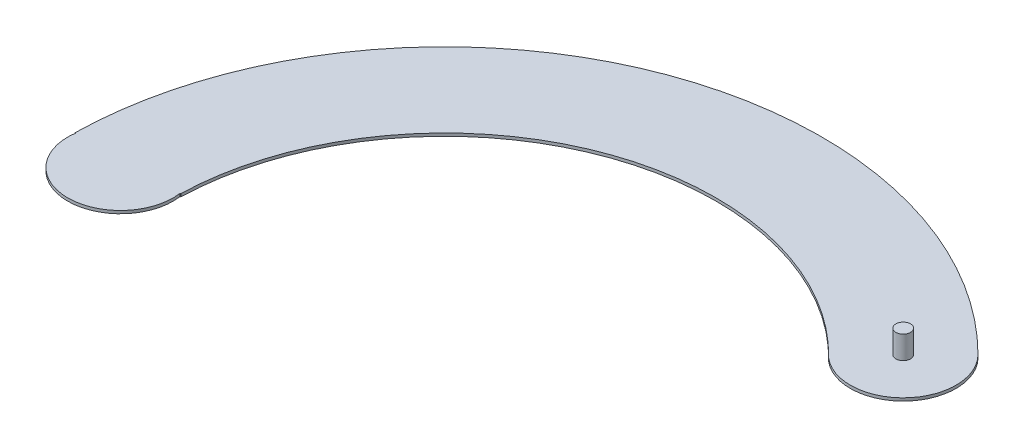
ISO-10303-21;
HEADER;
FILE_DESCRIPTION(('STEP AP214'),'2;1');
FILE_NAME('part.step','',(''),(''),'','','');
FILE_SCHEMA(('AUTOMOTIVE_DESIGN { 1 0 10303 214 1 1 1 1 }'));
ENDSEC;
DATA;
#1=APPLICATION_CONTEXT('core data for automotive mechanical design processes');
#2=APPLICATION_PROTOCOL_DEFINITION('international standard','automotive_design',2000,#1);
#3=PRODUCT_CONTEXT('',#1,'mechanical');
#4=PRODUCT('Part','Part','',(#3));
#5=PRODUCT_RELATED_PRODUCT_CATEGORY('part','',(#4));
#6=PRODUCT_DEFINITION_FORMATION('','',#4);
#7=PRODUCT_DEFINITION_CONTEXT('part definition',#1,'design');
#8=PRODUCT_DEFINITION('design','',#6,#7);
#9=PRODUCT_DEFINITION_SHAPE('','',#8);
#10=(LENGTH_UNIT() NAMED_UNIT(*) SI_UNIT(.MILLI.,.METRE.));
#11=(NAMED_UNIT(*) PLANE_ANGLE_UNIT() SI_UNIT($,.RADIAN.));
#12=(NAMED_UNIT(*) SI_UNIT($,.STERADIAN.) SOLID_ANGLE_UNIT());
#13=UNCERTAINTY_MEASURE_WITH_UNIT(LENGTH_MEASURE(1.E-05),#10,'distance_accuracy_value','');
#14=(GEOMETRIC_REPRESENTATION_CONTEXT(3) GLOBAL_UNCERTAINTY_ASSIGNED_CONTEXT((#13)) GLOBAL_UNIT_ASSIGNED_CONTEXT((#10,
#11,#12)) REPRESENTATION_CONTEXT('',''));
#15=CARTESIAN_POINT('',(0.,0.,0.));
#16=DIRECTION('',(0.,0.,1.));
#17=DIRECTION('',(1.,0.,0.));
#18=AXIS2_PLACEMENT_3D('',#15,#16,#17);
#19=CARTESIAN_POINT('',(0.,3.556,-1.));
#20=DIRECTION('',(0.,0.,-1.));
#21=DIRECTION('',(-1.,0.,0.));
#22=AXIS2_PLACEMENT_3D('',#19,#20,#21);
#23=PLANE('',#22);
#24=DIRECTION('',(1.,0.,0.));
#25=VECTOR('',#24,1.);
#26=CARTESIAN_POINT('',(0.,3.175,-1.));
#27=LINE('',#26,#25);
#28=CARTESIAN_POINT('',(-49.9899989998,3.175,-1.00000000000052));
#29=VERTEX_POINT('',#28);
#30=CARTESIAN_POINT('',(-49.9041866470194,3.175,-1.00000000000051));
#31=VERTEX_POINT('',#30);
#32=EDGE_CURVE('E125',#29,#31,#27,.T.);
#33=ORIENTED_EDGE('',*,*,#32,.T.);
#34=DIRECTION('',(0.,-1.,0.));
#35=VECTOR('',#34,1.);
#36=CARTESIAN_POINT('',(-49.9041866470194,3.556,-1.00000000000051));
#37=LINE('',#36,#35);
#38=CARTESIAN_POINT('',(-49.9041866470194,3.556,-1.00000000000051));
#39=VERTEX_POINT('',#38);
#40=EDGE_CURVE('E42',#39,#31,#37,.T.);
#41=ORIENTED_EDGE('',*,*,#40,.F.);
#42=DIRECTION('',(1.,0.,0.));
#43=VECTOR('',#42,1.);
#44=CARTESIAN_POINT('',(0.,3.556,-1.));
#45=LINE('',#44,#43);
#46=CARTESIAN_POINT('',(-49.9899989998,3.556,-1.00000000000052));
#47=VERTEX_POINT('',#46);
#48=EDGE_CURVE('E135',#47,#39,#45,.T.);
#49=ORIENTED_EDGE('',*,*,#48,.F.);
#50=DIRECTION('',(0.,-1.,0.));
#51=VECTOR('',#50,1.);
#52=CARTESIAN_POINT('',(-49.9899989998,3.556,-1.00000000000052));
#53=LINE('',#52,#51);
#54=EDGE_CURVE('E121',#47,#29,#53,.T.);
#55=ORIENTED_EDGE('',*,*,#54,.T.);
#56=EDGE_LOOP('',(#33,#41,#49,#55));
#57=FACE_BOUND('',#56,.T.);
#58=ADVANCED_FACE('F38',(#57),#23,.F.);
#59=CARTESIAN_POINT('',(-42.9880537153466,3.556,-4.44089209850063E-13));
#60=DIRECTION('',(0.,-1.,0.));
#61=DIRECTION('',(0.,0.,-1.));
#62=AXIS2_PLACEMENT_3D('',#59,#60,#61);
#63=CYLINDRICAL_SURFACE('',#62,6.98805371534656);
#64=CARTESIAN_POINT('',(-42.9880537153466,3.175,-4.44089209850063E-13));
#65=DIRECTION('',(0.,1.,0.));
#66=DIRECTION('',(0.,0.,1.));
#67=AXIS2_PLACEMENT_3D('',#64,#65,#66);
#68=CIRCLE('',#67,6.98805371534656);
#69=CARTESIAN_POINT('',(-36.0719207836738,3.175,-1.00000000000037));
#70=VERTEX_POINT('',#69);
#71=EDGE_CURVE('E128',#31,#70,#68,.T.);
#72=ORIENTED_EDGE('',*,*,#71,.T.);
#73=DIRECTION('',(0.,-1.,0.));
#74=VECTOR('',#73,1.);
#75=CARTESIAN_POINT('',(-36.0719207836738,3.556,-1.00000000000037));
#76=LINE('',#75,#74);
#77=CARTESIAN_POINT('',(-36.0719207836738,3.556,-1.00000000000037));
#78=VERTEX_POINT('',#77);
#79=EDGE_CURVE('E138',#78,#70,#76,.T.);
#80=ORIENTED_EDGE('',*,*,#79,.F.);
#81=CARTESIAN_POINT('',(-42.9880537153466,3.556,-4.44089209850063E-13));
#82=DIRECTION('',(0.,1.,0.));
#83=DIRECTION('',(0.,0.,1.));
#84=AXIS2_PLACEMENT_3D('',#81,#82,#83);
#85=CIRCLE('',#84,6.98805371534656);
#86=EDGE_CURVE('E94',#39,#78,#85,.T.);
#87=ORIENTED_EDGE('',*,*,#86,.F.);
#88=ORIENTED_EDGE('',*,*,#40,.T.);
#89=EDGE_LOOP('',(#72,#80,#87,#88));
#90=FACE_BOUND('',#89,.T.);
#91=ADVANCED_FACE('F40',(#90),#63,.T.);
#92=CARTESIAN_POINT('',(-35.9861084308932,3.175,-1.00000000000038));
#93=VERTEX_POINT('',#92);
#94=EDGE_CURVE('E130',#70,#93,#27,.T.);
#95=ORIENTED_EDGE('',*,*,#94,.T.);
#96=DIRECTION('',(0.,-1.,0.));
#97=VECTOR('',#96,1.);
#98=CARTESIAN_POINT('',(-35.9861084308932,3.556,-1.00000000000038));
#99=LINE('',#98,#97);
#100=CARTESIAN_POINT('',(-35.9861084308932,3.556,-1.00000000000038));
#101=VERTEX_POINT('',#100);
#102=EDGE_CURVE('E116',#101,#93,#99,.T.);
#103=ORIENTED_EDGE('',*,*,#102,.F.);
#104=EDGE_CURVE('E107',#78,#101,#45,.T.);
#105=ORIENTED_EDGE('',*,*,#104,.F.);
#106=ORIENTED_EDGE('',*,*,#79,.T.);
#107=EDGE_LOOP('',(#95,#103,#105,#106));
#108=FACE_BOUND('',#107,.T.);
#109=ADVANCED_FACE('F148',(#108),#23,.F.);
#110=CARTESIAN_POINT('',(0.,3.556,0.));
#111=DIRECTION('',(0.,-1.,0.));
#112=DIRECTION('',(0.,0.,-1.));
#113=AXIS2_PLACEMENT_3D('',#110,#111,#112);
#114=CYLINDRICAL_SURFACE('',#113,36.);
#115=CARTESIAN_POINT('',(0.,3.175,0.));
#116=DIRECTION('',(0.,1.,0.));
#117=DIRECTION('',(0.,0.,1.));
#118=AXIS2_PLACEMENT_3D('',#115,#116,#117);
#119=CIRCLE('',#118,36.);
#120=CARTESIAN_POINT('',(25.8273295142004,3.175,-25.0788566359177));
#121=VERTEX_POINT('',#120);
#122=EDGE_CURVE('E115',#93,#121,#119,.F.);
#123=ORIENTED_EDGE('',*,*,#122,.T.);
#124=DIRECTION('',(0.,-1.,0.));
#125=VECTOR('',#124,1.);
#126=CARTESIAN_POINT('',(25.8273295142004,3.556,-25.0788566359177));
#127=LINE('',#126,#125);
#128=CARTESIAN_POINT('',(25.8273295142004,3.556,-25.0788566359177));
#129=VERTEX_POINT('',#128);
#130=EDGE_CURVE('E112',#129,#121,#127,.T.);
#131=ORIENTED_EDGE('',*,*,#130,.F.);
#132=CARTESIAN_POINT('',(0.,3.556,0.));
#133=DIRECTION('',(0.,1.,0.));
#134=DIRECTION('',(0.,0.,1.));
#135=AXIS2_PLACEMENT_3D('',#132,#133,#134);
#136=CIRCLE('',#135,36.);
#137=EDGE_CURVE('E101',#101,#129,#136,.F.);
#138=ORIENTED_EDGE('',*,*,#137,.F.);
#139=ORIENTED_EDGE('',*,*,#102,.T.);
#140=EDGE_LOOP('',(#123,#131,#138,#139));
#141=FACE_BOUND('',#140,.T.);
#142=ADVANCED_FACE('F113',(#141),#114,.F.);
#143=CARTESIAN_POINT('',(30.3971442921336,3.556,-30.3971442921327));
#144=DIRECTION('',(0.,-1.,0.));
#145=DIRECTION('',(0.,0.,-1.));
#146=AXIS2_PLACEMENT_3D('',#143,#144,#145);
#147=CYLINDRICAL_SURFACE('',#146,7.01194628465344);
#148=CARTESIAN_POINT('',(30.3971442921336,3.175,-30.3971442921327));
#149=DIRECTION('',(0.,1.,0.));
#150=DIRECTION('',(0.,0.,1.));
#151=AXIS2_PLACEMENT_3D('',#148,#149,#150);
#152=CIRCLE('',#151,7.01194628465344);
#153=CARTESIAN_POINT('',(35.355339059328,3.175,-35.3553390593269));
#154=VERTEX_POINT('',#153);
#155=EDGE_CURVE('E79',#121,#154,#152,.T.);
#156=ORIENTED_EDGE('',*,*,#155,.T.);
#157=DIRECTION('',(0.,-1.,0.));
#158=VECTOR('',#157,1.);
#159=CARTESIAN_POINT('',(35.355339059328,3.556,-35.3553390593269));
#160=LINE('',#159,#158);
#161=CARTESIAN_POINT('',(35.355339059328,3.556,-35.3553390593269));
#162=VERTEX_POINT('',#161);
#163=EDGE_CURVE('E117',#162,#154,#160,.T.);
#164=ORIENTED_EDGE('',*,*,#163,.F.);
#165=CARTESIAN_POINT('',(30.3971442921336,3.556,-30.3971442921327));
#166=DIRECTION('',(0.,1.,0.));
#167=DIRECTION('',(0.,0.,1.));
#168=AXIS2_PLACEMENT_3D('',#165,#166,#167);
#169=CIRCLE('',#168,7.01194628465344);
#170=EDGE_CURVE('E105',#129,#162,#169,.T.);
#171=ORIENTED_EDGE('',*,*,#170,.F.);
#172=ORIENTED_EDGE('',*,*,#130,.T.);
#173=EDGE_LOOP('',(#156,#164,#171,#172));
#174=FACE_BOUND('',#173,.T.);
#175=ADVANCED_FACE('F119',(#174),#147,.T.);
#176=CARTESIAN_POINT('',(0.,3.556,0.));
#177=DIRECTION('',(0.,-1.,0.));
#178=DIRECTION('',(0.,0.,-1.));
#179=AXIS2_PLACEMENT_3D('',#176,#177,#178);
#180=CYLINDRICAL_SURFACE('',#179,50.);
#181=CARTESIAN_POINT('',(0.,3.175,0.));
#182=DIRECTION('',(0.,1.,0.));
#183=DIRECTION('',(0.,0.,1.));
#184=AXIS2_PLACEMENT_3D('',#181,#182,#183);
#185=CIRCLE('',#184,50.);
#186=EDGE_CURVE('E85',#154,#29,#185,.T.);
#187=ORIENTED_EDGE('',*,*,#186,.T.);
#188=ORIENTED_EDGE('',*,*,#54,.F.);
#189=CARTESIAN_POINT('',(0.,3.556,0.));
#190=DIRECTION('',(0.,1.,0.));
#191=DIRECTION('',(0.,0.,1.));
#192=AXIS2_PLACEMENT_3D('',#189,#190,#191);
#193=CIRCLE('',#192,50.);
#194=EDGE_CURVE('E56',#162,#47,#193,.T.);
#195=ORIENTED_EDGE('',*,*,#194,.F.);
#196=ORIENTED_EDGE('',*,*,#163,.T.);
#197=EDGE_LOOP('',(#187,#188,#195,#196));
#198=FACE_BOUND('',#197,.T.);
#199=ADVANCED_FACE('F178',(#198),#180,.T.);
#200=CARTESIAN_POINT('',(0.,3.556,0.));
#201=DIRECTION('',(0.,1.,0.));
#202=DIRECTION('',(0.,0.,1.));
#203=AXIS2_PLACEMENT_3D('',#200,#201,#202);
#204=PLANE('',#203);
#205=CARTESIAN_POINT('',(30.3971442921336,3.556,-30.3971442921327));
#206=DIRECTION('',(0.,1.,0.));
#207=DIRECTION('',(0.,0.,1.));
#208=AXIS2_PLACEMENT_3D('',#205,#206,#207);
#209=CIRCLE('',#208,0.975);
#210=CARTESIAN_POINT('',(30.3971442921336,3.556,-31.3721442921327));
#211=VERTEX_POINT('',#210);
#212=EDGE_CURVE('E151',#211,#211,#209,.T.);
#213=ORIENTED_EDGE('',*,*,#212,.F.);
#214=EDGE_LOOP('',(#213));
#215=FACE_BOUND('',#214,.T.);
#216=ORIENTED_EDGE('',*,*,#48,.T.);
#217=ORIENTED_EDGE('',*,*,#86,.T.);
#218=ORIENTED_EDGE('',*,*,#104,.T.);
#219=ORIENTED_EDGE('',*,*,#137,.T.);
#220=ORIENTED_EDGE('',*,*,#170,.T.);
#221=ORIENTED_EDGE('',*,*,#194,.T.);
#222=EDGE_LOOP('',(#216,#217,#218,#219,#220,#221));
#223=FACE_BOUND('',#222,.T.);
#224=ADVANCED_FACE('F103',(#215,#223),#204,.T.);
#225=CARTESIAN_POINT('',(0.,3.175,0.));
#226=DIRECTION('',(0.,1.,0.));
#227=DIRECTION('',(0.,0.,1.));
#228=AXIS2_PLACEMENT_3D('',#225,#226,#227);
#229=PLANE('',#228);
#230=CARTESIAN_POINT('',(-42.9880537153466,3.175,-4.44089209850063E-13));
#231=DIRECTION('',(0.,-1.,0.));
#232=DIRECTION('',(0.,0.,-1.));
#233=AXIS2_PLACEMENT_3D('',#230,#231,#232);
#234=CIRCLE('',#233,0.974999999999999);
#235=CARTESIAN_POINT('',(-42.9880537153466,3.175,0.974999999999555));
#236=VERTEX_POINT('',#235);
#237=EDGE_CURVE('E11',#236,#236,#234,.T.);
#238=ORIENTED_EDGE('',*,*,#237,.F.);
#239=EDGE_LOOP('',(#238));
#240=FACE_BOUND('',#239,.T.);
#241=ORIENTED_EDGE('',*,*,#32,.F.);
#242=ORIENTED_EDGE('',*,*,#186,.F.);
#243=ORIENTED_EDGE('',*,*,#155,.F.);
#244=ORIENTED_EDGE('',*,*,#122,.F.);
#245=ORIENTED_EDGE('',*,*,#94,.F.);
#246=ORIENTED_EDGE('',*,*,#71,.F.);
#247=EDGE_LOOP('',(#241,#242,#243,#244,#245,#246));
#248=FACE_BOUND('',#247,.T.);
#249=ADVANCED_FACE('F147',(#240,#248),#229,.F.);
#250=CARTESIAN_POINT('',(30.3971442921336,6.604,-30.3971442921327));
#251=DIRECTION('',(0.,-1.,0.));
#252=DIRECTION('',(0.,0.,-1.));
#253=AXIS2_PLACEMENT_3D('',#250,#251,#252);
#254=CYLINDRICAL_SURFACE('',#253,0.975);
#255=CARTESIAN_POINT('',(30.3971442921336,6.604,-30.3971442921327));
#256=DIRECTION('',(0.,1.,0.));
#257=DIRECTION('',(0.,0.,1.));
#258=AXIS2_PLACEMENT_3D('',#255,#256,#257);
#259=CIRCLE('',#258,0.975);
#260=CARTESIAN_POINT('',(30.3971442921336,6.604,-31.3721442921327));
#261=VERTEX_POINT('',#260);
#262=EDGE_CURVE('E129',#261,#261,#259,.T.);
#263=CARTESIAN_POINT('',(30.3971442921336,6.604,-31.3721442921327));
#264=CARTESIAN_POINT('',(30.3971442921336,6.57225,-31.3721442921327));
#265=CARTESIAN_POINT('',(30.3971442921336,6.5405,-31.3721442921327));
#266=CARTESIAN_POINT('',(30.3971442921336,6.477,-31.3721442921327));
#267=CARTESIAN_POINT('',(30.3971442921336,6.44525,-31.3721442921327));
#268=CARTESIAN_POINT('',(30.3971442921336,6.38175,-31.3721442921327));
#269=CARTESIAN_POINT('',(30.3971442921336,6.35,-31.3721442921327));
#270=CARTESIAN_POINT('',(30.3971442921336,6.2865,-31.3721442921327));
#271=CARTESIAN_POINT('',(30.3971442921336,6.25475,-31.3721442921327));
#272=CARTESIAN_POINT('',(30.3971442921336,6.19125,-31.3721442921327));
#273=CARTESIAN_POINT('',(30.3971442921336,6.1595,-31.3721442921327));
#274=CARTESIAN_POINT('',(30.3971442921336,6.096,-31.3721442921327));
#275=CARTESIAN_POINT('',(30.3971442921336,6.06425,-31.3721442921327));
#276=CARTESIAN_POINT('',(30.3971442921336,6.00075,-31.3721442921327));
#277=CARTESIAN_POINT('',(30.3971442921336,5.969,-31.3721442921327));
#278=CARTESIAN_POINT('',(30.3971442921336,5.9055,-31.3721442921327));
#279=CARTESIAN_POINT('',(30.3971442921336,5.87375,-31.3721442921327));
#280=CARTESIAN_POINT('',(30.3971442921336,5.81025,-31.3721442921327));
#281=CARTESIAN_POINT('',(30.3971442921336,5.7785,-31.3721442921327));
#282=CARTESIAN_POINT('',(30.3971442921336,5.715,-31.3721442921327));
#283=CARTESIAN_POINT('',(30.3971442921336,5.68325,-31.3721442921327));
#284=CARTESIAN_POINT('',(30.3971442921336,5.61975,-31.3721442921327));
#285=CARTESIAN_POINT('',(30.3971442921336,5.588,-31.3721442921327));
#286=CARTESIAN_POINT('',(30.3971442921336,5.5245,-31.3721442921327));
#287=CARTESIAN_POINT('',(30.3971442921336,5.49275,-31.3721442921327));
#288=CARTESIAN_POINT('',(30.3971442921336,5.42925,-31.3721442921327));
#289=CARTESIAN_POINT('',(30.3971442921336,5.3975,-31.3721442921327));
#290=CARTESIAN_POINT('',(30.3971442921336,5.334,-31.3721442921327));
#291=CARTESIAN_POINT('',(30.3971442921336,5.30225,-31.3721442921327));
#292=CARTESIAN_POINT('',(30.3971442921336,5.23875,-31.3721442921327));
#293=CARTESIAN_POINT('',(30.3971442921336,5.207,-31.3721442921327));
#294=CARTESIAN_POINT('',(30.3971442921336,5.1435,-31.3721442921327));
#295=CARTESIAN_POINT('',(30.3971442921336,5.11175,-31.3721442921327));
#296=CARTESIAN_POINT('',(30.3971442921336,5.04825,-31.3721442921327));
#297=CARTESIAN_POINT('',(30.3971442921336,5.0165,-31.3721442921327));
#298=CARTESIAN_POINT('',(30.3971442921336,4.953,-31.3721442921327));
#299=CARTESIAN_POINT('',(30.3971442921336,4.92125,-31.3721442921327));
#300=CARTESIAN_POINT('',(30.3971442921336,4.85775,-31.3721442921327));
#301=CARTESIAN_POINT('',(30.3971442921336,4.826,-31.3721442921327));
#302=CARTESIAN_POINT('',(30.3971442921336,4.7625,-31.3721442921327));
#303=CARTESIAN_POINT('',(30.3971442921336,4.73075,-31.3721442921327));
#304=CARTESIAN_POINT('',(30.3971442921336,4.66725,-31.3721442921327));
#305=CARTESIAN_POINT('',(30.3971442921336,4.6355,-31.3721442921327));
#306=CARTESIAN_POINT('',(30.3971442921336,4.572,-31.3721442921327));
#307=CARTESIAN_POINT('',(30.3971442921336,4.54025,-31.3721442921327));
#308=CARTESIAN_POINT('',(30.3971442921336,4.47675,-31.3721442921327));
#309=CARTESIAN_POINT('',(30.3971442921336,4.445,-31.3721442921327));
#310=CARTESIAN_POINT('',(30.3971442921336,4.3815,-31.3721442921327));
#311=CARTESIAN_POINT('',(30.3971442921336,4.34975,-31.3721442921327));
#312=CARTESIAN_POINT('',(30.3971442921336,4.28625,-31.3721442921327));
#313=CARTESIAN_POINT('',(30.3971442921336,4.2545,-31.3721442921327));
#314=CARTESIAN_POINT('',(30.3971442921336,4.191,-31.3721442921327));
#315=CARTESIAN_POINT('',(30.3971442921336,4.15925,-31.3721442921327));
#316=CARTESIAN_POINT('',(30.3971442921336,4.09575,-31.3721442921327));
#317=CARTESIAN_POINT('',(30.3971442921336,4.064,-31.3721442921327));
#318=CARTESIAN_POINT('',(30.3971442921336,4.0005,-31.3721442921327));
#319=CARTESIAN_POINT('',(30.3971442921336,3.96875,-31.3721442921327));
#320=CARTESIAN_POINT('',(30.3971442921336,3.90525,-31.3721442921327));
#321=CARTESIAN_POINT('',(30.3971442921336,3.8735,-31.3721442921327));
#322=CARTESIAN_POINT('',(30.3971442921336,3.81,-31.3721442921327));
#323=CARTESIAN_POINT('',(30.3971442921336,3.77825,-31.3721442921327));
#324=CARTESIAN_POINT('',(30.3971442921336,3.71475,-31.3721442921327));
#325=CARTESIAN_POINT('',(30.3971442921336,3.683,-31.3721442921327));
#326=CARTESIAN_POINT('',(30.3971442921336,3.6195,-31.3721442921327));
#327=CARTESIAN_POINT('',(30.3971442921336,3.58775,-31.3721442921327));
#328=CARTESIAN_POINT('',(30.3971442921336,3.556,-31.3721442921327));
#329=B_SPLINE_CURVE_WITH_KNOTS('',3,(#263,#264,#265,#266,#267,#268,#269,#270,#271,#272,#273,
#274,#275,#276,#277,#278,#279,#280,#281,#282,#283,#284,#285,#286,#287,#288,#289,#290,#291,#292,
#293,#294,#295,#296,#297,#298,#299,#300,#301,#302,#303,#304,#305,#306,#307,#308,#309,#310,#311,
#312,#313,#314,#315,#316,#317,#318,#319,#320,#321,#322,#323,#324,#325,#326,#327,#328),
.UNSPECIFIED.,.F.,.F.,(4,2,2,2,2,2,2,2,2,2,2,2,2,2,2,2,2,2,2,2,2,2,2,2,2,2,2,2,2,2,2,2,4),(0.,
0.0952500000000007,0.190500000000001,0.28575,0.381,0.47625,0.5715,0.666750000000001,
0.762000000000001,0.85725,0.9525,1.04775,1.143,1.23825,1.3335,1.42875,1.524,1.61925,1.7145,
1.80975,1.905,2.00025,2.0955,2.19075,2.286,2.38125,2.4765,2.57175,2.667,2.76225,2.8575,2.95275,
3.048),.UNSPECIFIED.);
#330=EDGE_CURVE('BSEAM170',#261,#211,#329,.T.);
#331=ORIENTED_EDGE('',*,*,#262,.F.);
#332=ORIENTED_EDGE('',*,*,#212,.T.);
#333=ORIENTED_EDGE('',*,*,#330,.T.);
#334=ORIENTED_EDGE('',*,*,#330,.F.);
#335=EDGE_LOOP('',(#331,#333,#332,#334));
#336=FACE_BOUND('',#335,.T.);
#337=ADVANCED_FACE('F170',(#336),#254,.T.);
#338=CARTESIAN_POINT('',(30.3971442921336,6.604,-30.3971442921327));
#339=DIRECTION('',(0.,1.,0.));
#340=DIRECTION('',(0.,0.,1.));
#341=AXIS2_PLACEMENT_3D('',#338,#339,#340);
#342=PLANE('',#341);
#343=ORIENTED_EDGE('',*,*,#262,.T.);
#344=EDGE_LOOP('',(#343));
#345=FACE_BOUND('',#344,.T.);
#346=ADVANCED_FACE('F165',(#345),#342,.T.);
#347=CARTESIAN_POINT('',(-42.9880537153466,0.127,-4.44089209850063E-13));
#348=DIRECTION('',(0.,1.,0.));
#349=DIRECTION('',(0.,0.,1.));
#350=AXIS2_PLACEMENT_3D('',#347,#348,#349);
#351=CYLINDRICAL_SURFACE('',#350,0.974999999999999);
#352=CARTESIAN_POINT('',(-42.9880537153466,0.127,-4.44089209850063E-13));
#353=DIRECTION('',(0.,-1.,0.));
#354=DIRECTION('',(0.,0.,-1.));
#355=AXIS2_PLACEMENT_3D('',#352,#353,#354);
#356=CIRCLE('',#355,0.974999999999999);
#357=CARTESIAN_POINT('',(-42.9880537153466,0.127,0.974999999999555));
#358=VERTEX_POINT('',#357);
#359=EDGE_CURVE('E154',#358,#358,#356,.T.);
#360=CARTESIAN_POINT('',(-42.9880537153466,0.127,0.974999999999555));
#361=CARTESIAN_POINT('',(-42.9880537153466,0.15875,0.974999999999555));
#362=CARTESIAN_POINT('',(-42.9880537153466,0.1905,0.974999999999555));
#363=CARTESIAN_POINT('',(-42.9880537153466,0.254,0.974999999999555));
#364=CARTESIAN_POINT('',(-42.9880537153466,0.28575,0.974999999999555));
#365=CARTESIAN_POINT('',(-42.9880537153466,0.34925,0.974999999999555));
#366=CARTESIAN_POINT('',(-42.9880537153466,0.381,0.974999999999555));
#367=CARTESIAN_POINT('',(-42.9880537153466,0.4445,0.974999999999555));
#368=CARTESIAN_POINT('',(-42.9880537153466,0.47625,0.974999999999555));
#369=CARTESIAN_POINT('',(-42.9880537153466,0.53975,0.974999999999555));
#370=CARTESIAN_POINT('',(-42.9880537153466,0.5715,0.974999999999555));
#371=CARTESIAN_POINT('',(-42.9880537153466,0.635,0.974999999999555));
#372=CARTESIAN_POINT('',(-42.9880537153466,0.66675,0.974999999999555));
#373=CARTESIAN_POINT('',(-42.9880537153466,0.73025,0.974999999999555));
#374=CARTESIAN_POINT('',(-42.9880537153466,0.762,0.974999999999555));
#375=CARTESIAN_POINT('',(-42.9880537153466,0.8255,0.974999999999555));
#376=CARTESIAN_POINT('',(-42.9880537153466,0.85725,0.974999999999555));
#377=CARTESIAN_POINT('',(-42.9880537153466,0.92075,0.974999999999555));
#378=CARTESIAN_POINT('',(-42.9880537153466,0.9525,0.974999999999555));
#379=CARTESIAN_POINT('',(-42.9880537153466,1.016,0.974999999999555));
#380=CARTESIAN_POINT('',(-42.9880537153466,1.04775,0.974999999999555));
#381=CARTESIAN_POINT('',(-42.9880537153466,1.11125,0.974999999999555));
#382=CARTESIAN_POINT('',(-42.9880537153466,1.143,0.974999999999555));
#383=CARTESIAN_POINT('',(-42.9880537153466,1.2065,0.974999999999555));
#384=CARTESIAN_POINT('',(-42.9880537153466,1.23825,0.974999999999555));
#385=CARTESIAN_POINT('',(-42.9880537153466,1.30175,0.974999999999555));
#386=CARTESIAN_POINT('',(-42.9880537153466,1.3335,0.974999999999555));
#387=CARTESIAN_POINT('',(-42.9880537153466,1.397,0.974999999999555));
#388=CARTESIAN_POINT('',(-42.9880537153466,1.42875,0.974999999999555));
#389=CARTESIAN_POINT('',(-42.9880537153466,1.49225,0.974999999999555));
#390=CARTESIAN_POINT('',(-42.9880537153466,1.524,0.974999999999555));
#391=CARTESIAN_POINT('',(-42.9880537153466,1.5875,0.974999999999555));
#392=CARTESIAN_POINT('',(-42.9880537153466,1.61925,0.974999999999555));
#393=CARTESIAN_POINT('',(-42.9880537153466,1.68275,0.974999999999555));
#394=CARTESIAN_POINT('',(-42.9880537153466,1.7145,0.974999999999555));
#395=CARTESIAN_POINT('',(-42.9880537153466,1.778,0.974999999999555));
#396=CARTESIAN_POINT('',(-42.9880537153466,1.80975,0.974999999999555));
#397=CARTESIAN_POINT('',(-42.9880537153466,1.87325,0.974999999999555));
#398=CARTESIAN_POINT('',(-42.9880537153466,1.905,0.974999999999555));
#399=CARTESIAN_POINT('',(-42.9880537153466,1.9685,0.974999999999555));
#400=CARTESIAN_POINT('',(-42.9880537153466,2.00025,0.974999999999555));
#401=CARTESIAN_POINT('',(-42.9880537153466,2.06375,0.974999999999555));
#402=CARTESIAN_POINT('',(-42.9880537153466,2.0955,0.974999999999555));
#403=CARTESIAN_POINT('',(-42.9880537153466,2.159,0.974999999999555));
#404=CARTESIAN_POINT('',(-42.9880537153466,2.19075,0.974999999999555));
#405=CARTESIAN_POINT('',(-42.9880537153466,2.25425,0.974999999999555));
#406=CARTESIAN_POINT('',(-42.9880537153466,2.286,0.974999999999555));
#407=CARTESIAN_POINT('',(-42.9880537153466,2.3495,0.974999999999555));
#408=CARTESIAN_POINT('',(-42.9880537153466,2.38125,0.974999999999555));
#409=CARTESIAN_POINT('',(-42.9880537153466,2.44475,0.974999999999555));
#410=CARTESIAN_POINT('',(-42.9880537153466,2.4765,0.974999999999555));
#411=CARTESIAN_POINT('',(-42.9880537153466,2.54,0.974999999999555));
#412=CARTESIAN_POINT('',(-42.9880537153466,2.57175,0.974999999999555));
#413=CARTESIAN_POINT('',(-42.9880537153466,2.63525,0.974999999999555));
#414=CARTESIAN_POINT('',(-42.9880537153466,2.667,0.974999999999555));
#415=CARTESIAN_POINT('',(-42.9880537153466,2.7305,0.974999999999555));
#416=CARTESIAN_POINT('',(-42.9880537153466,2.76225,0.974999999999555));
#417=CARTESIAN_POINT('',(-42.9880537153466,2.82575,0.974999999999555));
#418=CARTESIAN_POINT('',(-42.9880537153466,2.8575,0.974999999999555));
#419=CARTESIAN_POINT('',(-42.9880537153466,2.921,0.974999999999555));
#420=CARTESIAN_POINT('',(-42.9880537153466,2.95275,0.974999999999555));
#421=CARTESIAN_POINT('',(-42.9880537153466,3.01625,0.974999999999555));
#422=CARTESIAN_POINT('',(-42.9880537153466,3.048,0.974999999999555));
#423=CARTESIAN_POINT('',(-42.9880537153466,3.1115,0.974999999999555));
#424=CARTESIAN_POINT('',(-42.9880537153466,3.14325,0.974999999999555));
#425=CARTESIAN_POINT('',(-42.9880537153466,3.175,0.974999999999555));
#426=B_SPLINE_CURVE_WITH_KNOTS('',3,(#360,#361,#362,#363,#364,#365,#366,#367,#368,#369,#370,
#371,#372,#373,#374,#375,#376,#377,#378,#379,#380,#381,#382,#383,#384,#385,#386,#387,#388,#389,
#390,#391,#392,#393,#394,#395,#396,#397,#398,#399,#400,#401,#402,#403,#404,#405,#406,#407,#408,
#409,#410,#411,#412,#413,#414,#415,#416,#417,#418,#419,#420,#421,#422,#423,#424,#425),
.UNSPECIFIED.,.F.,.F.,(4,2,2,2,2,2,2,2,2,2,2,2,2,2,2,2,2,2,2,2,2,2,2,2,2,2,2,2,2,2,2,2,4),(0.,
0.09525,0.1905,0.28575,0.381,0.47625,0.5715,0.66675,0.762,0.85725,0.9525,1.04775,1.143,1.23825,
1.3335,1.42875,1.524,1.61925,1.7145,1.80975,1.905,2.00025,2.0955,2.19075,2.286,2.38125,2.4765,
2.57175,2.667,2.76225,2.8575,2.95275,3.048),.UNSPECIFIED.);
#427=EDGE_CURVE('BSEAM162',#358,#236,#426,.T.);
#428=ORIENTED_EDGE('',*,*,#359,.F.);
#429=ORIENTED_EDGE('',*,*,#237,.T.);
#430=ORIENTED_EDGE('',*,*,#427,.T.);
#431=ORIENTED_EDGE('',*,*,#427,.F.);
#432=EDGE_LOOP('',(#428,#430,#429,#431));
#433=FACE_BOUND('',#432,.T.);
#434=ADVANCED_FACE('F162',(#433),#351,.T.);
#435=CARTESIAN_POINT('',(0.,0.127,0.));
#436=DIRECTION('',(0.,-1.,0.));
#437=DIRECTION('',(0.,0.,-1.));
#438=AXIS2_PLACEMENT_3D('',#435,#436,#437);
#439=PLANE('',#438);
#440=ORIENTED_EDGE('',*,*,#359,.T.);
#441=EDGE_LOOP('',(#440));
#442=FACE_BOUND('',#441,.T.);
#443=ADVANCED_FACE('F160',(#442),#439,.T.);
#444=CLOSED_SHELL('',(#58,#91,#109,#142,#175,#199,#224,#249,#337,#346,#434,#443));
#445=MANIFOLD_SOLID_BREP('B2',#444);
#446=ADVANCED_BREP_SHAPE_REPRESENTATION('',(#18,#445),#14);
#447=SHAPE_DEFINITION_REPRESENTATION(#9,#446);
ENDSEC;
END-ISO-10303-21;
